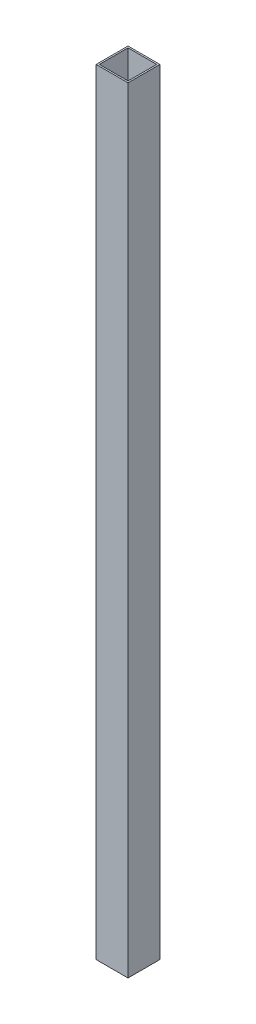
from build123d import *

# Parameters (mm, degrees)
SKETCH1_W           = 50
SKETCH1_H           = 50
BOSS_EXTRUDE1_DEPTH = 1216
SHELL1_T            = -2.5


with BuildPart() as part:
    # Sketch1 → Boss-Extrude1 (new body)
    with BuildSketch(Plane(origin=(0, 0, 0), x_dir=(1, 0, 0), z_dir=(0, 1, 0))):
        Rectangle(SKETCH1_W, SKETCH1_H)
    extrude(amount=BOSS_EXTRUDE1_DEPTH)

    # Shell1
    shell1_openings = [part.faces().sort_by_distance(p)[0] for p in [
        (0, 1216, 0),
        (0, 0, 0),
    ]]
    offset(amount=SHELL1_T, openings=shell1_openings, kind=Kind.INTERSECTION)


solid = part.part
